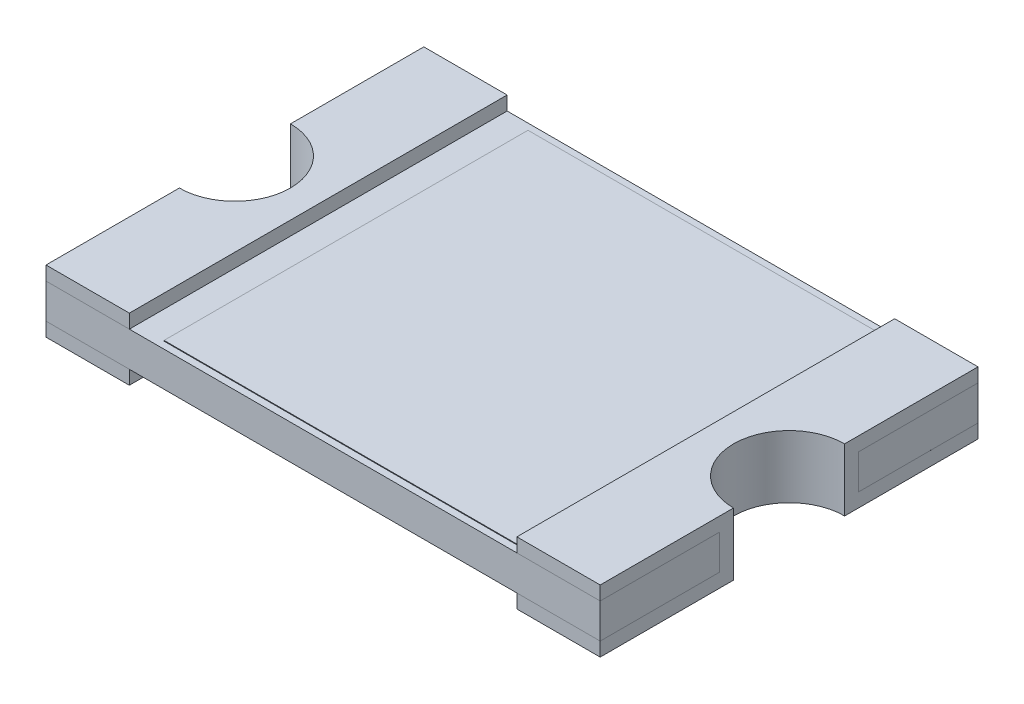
ISO-10303-21;
HEADER;
FILE_DESCRIPTION(('STEP AP214'),'2;1');
FILE_NAME('part.step','',(''),(''),'','','');
FILE_SCHEMA(('AUTOMOTIVE_DESIGN { 1 0 10303 214 1 1 1 1 }'));
ENDSEC;
DATA;
#1=APPLICATION_CONTEXT('core data for automotive mechanical design processes');
#2=APPLICATION_PROTOCOL_DEFINITION('international standard','automotive_design',2000,#1);
#3=PRODUCT_CONTEXT('',#1,'mechanical');
#4=PRODUCT('Part','Part','',(#3));
#5=PRODUCT_RELATED_PRODUCT_CATEGORY('part','',(#4));
#6=PRODUCT_DEFINITION_FORMATION('','',#4);
#7=PRODUCT_DEFINITION_CONTEXT('part definition',#1,'design');
#8=PRODUCT_DEFINITION('design','',#6,#7);
#9=PRODUCT_DEFINITION_SHAPE('','',#8);
#10=(LENGTH_UNIT() NAMED_UNIT(*) SI_UNIT(.MILLI.,.METRE.));
#11=(NAMED_UNIT(*) PLANE_ANGLE_UNIT() SI_UNIT($,.RADIAN.));
#12=(NAMED_UNIT(*) SI_UNIT($,.STERADIAN.) SOLID_ANGLE_UNIT());
#13=UNCERTAINTY_MEASURE_WITH_UNIT(LENGTH_MEASURE(1.E-05),#10,'distance_accuracy_value','');
#14=(GEOMETRIC_REPRESENTATION_CONTEXT(3) GLOBAL_UNCERTAINTY_ASSIGNED_CONTEXT((#13)) GLOBAL_UNIT_ASSIGNED_CONTEXT((#10,
#11,#12)) REPRESENTATION_CONTEXT('',''));
#15=CARTESIAN_POINT('',(0.,0.,0.));
#16=DIRECTION('',(0.,0.,1.));
#17=DIRECTION('',(1.,0.,0.));
#18=AXIS2_PLACEMENT_3D('',#15,#16,#17);
#19=CARTESIAN_POINT('',(-2.39,0.71,-2.62));
#20=DIRECTION('',(1.,0.,0.));
#21=DIRECTION('',(0.,0.,-1.));
#22=AXIS2_PLACEMENT_3D('',#19,#20,#21);
#23=PLANE('',#22);
#24=DIRECTION('',(0.,0.,1.));
#25=VECTOR('',#24,1.);
#26=CARTESIAN_POINT('',(-2.39,0.7,-2.62));
#27=LINE('',#26,#25);
#28=CARTESIAN_POINT('',(-2.39,0.7,-2.62));
#29=VERTEX_POINT('',#28);
#30=CARTESIAN_POINT('',(-2.39,0.7,2.62));
#31=VERTEX_POINT('',#30);
#32=EDGE_CURVE('E113',#29,#31,#27,.T.);
#33=ORIENTED_EDGE('',*,*,#32,.T.);
#34=DIRECTION('',(0.,-1.,0.));
#35=VECTOR('',#34,1.);
#36=CARTESIAN_POINT('',(-2.39,0.71,2.62));
#37=LINE('',#36,#35);
#38=CARTESIAN_POINT('',(-2.39,0.71,2.62));
#39=VERTEX_POINT('',#38);
#40=EDGE_CURVE('E12',#39,#31,#37,.T.);
#41=ORIENTED_EDGE('',*,*,#40,.F.);
#42=DIRECTION('',(0.,0.,1.));
#43=VECTOR('',#42,1.);
#44=CARTESIAN_POINT('',(-2.39,0.71,-2.62));
#45=LINE('',#44,#43);
#46=CARTESIAN_POINT('',(-2.39,0.71,-2.62));
#47=VERTEX_POINT('',#46);
#48=EDGE_CURVE('E101',#47,#39,#45,.T.);
#49=ORIENTED_EDGE('',*,*,#48,.F.);
#50=DIRECTION('',(0.,-1.,0.));
#51=VECTOR('',#50,1.);
#52=CARTESIAN_POINT('',(-2.39,0.71,-2.62));
#53=LINE('',#52,#51);
#54=EDGE_CURVE('E109',#47,#29,#53,.T.);
#55=ORIENTED_EDGE('',*,*,#54,.T.);
#56=EDGE_LOOP('',(#33,#41,#49,#55));
#57=FACE_BOUND('',#56,.T.);
#58=ADVANCED_FACE('F50',(#57),#23,.F.);
#59=CARTESIAN_POINT('',(-2.39,0.71,2.62));
#60=DIRECTION('',(0.,0.,-1.));
#61=DIRECTION('',(-1.,0.,0.));
#62=AXIS2_PLACEMENT_3D('',#59,#60,#61);
#63=PLANE('',#62);
#64=DIRECTION('',(1.,0.,0.));
#65=VECTOR('',#64,1.);
#66=CARTESIAN_POINT('',(-2.39,0.7,2.62));
#67=LINE('',#66,#65);
#68=CARTESIAN_POINT('',(2.79,0.7,2.62));
#69=VERTEX_POINT('',#68);
#70=EDGE_CURVE('E105',#31,#69,#67,.T.);
#71=ORIENTED_EDGE('',*,*,#70,.T.);
#72=DIRECTION('',(0.,-1.,0.));
#73=VECTOR('',#72,1.);
#74=CARTESIAN_POINT('',(2.79,0.71,2.62));
#75=LINE('',#74,#73);
#76=CARTESIAN_POINT('',(2.79,0.71,2.62));
#77=VERTEX_POINT('',#76);
#78=EDGE_CURVE('E58',#77,#69,#75,.T.);
#79=ORIENTED_EDGE('',*,*,#78,.F.);
#80=DIRECTION('',(1.,0.,0.));
#81=VECTOR('',#80,1.);
#82=CARTESIAN_POINT('',(-2.39,0.71,2.62));
#83=LINE('',#82,#81);
#84=EDGE_CURVE('E96',#39,#77,#83,.T.);
#85=ORIENTED_EDGE('',*,*,#84,.F.);
#86=ORIENTED_EDGE('',*,*,#40,.T.);
#87=EDGE_LOOP('',(#71,#79,#85,#86));
#88=FACE_BOUND('',#87,.T.);
#89=ADVANCED_FACE('F104',(#88),#63,.F.);
#90=CARTESIAN_POINT('',(2.79,0.71,-2.62));
#91=DIRECTION('',(-1.,0.,0.));
#92=DIRECTION('',(0.,0.,1.));
#93=AXIS2_PLACEMENT_3D('',#90,#91,#92);
#94=PLANE('',#93);
#95=DIRECTION('',(0.,0.,-1.));
#96=VECTOR('',#95,1.);
#97=CARTESIAN_POINT('',(2.79,0.7,-2.62));
#98=LINE('',#97,#96);
#99=CARTESIAN_POINT('',(2.79,0.7,-2.62));
#100=VERTEX_POINT('',#99);
#101=EDGE_CURVE('E83',#69,#100,#98,.T.);
#102=ORIENTED_EDGE('',*,*,#101,.T.);
#103=DIRECTION('',(0.,-1.,0.));
#104=VECTOR('',#103,1.);
#105=CARTESIAN_POINT('',(2.79,0.71,-2.62));
#106=LINE('',#105,#104);
#107=CARTESIAN_POINT('',(2.79,0.71,-2.62));
#108=VERTEX_POINT('',#107);
#109=EDGE_CURVE('E106',#108,#100,#106,.T.);
#110=ORIENTED_EDGE('',*,*,#109,.F.);
#111=DIRECTION('',(0.,0.,-1.));
#112=VECTOR('',#111,1.);
#113=CARTESIAN_POINT('',(2.79,0.71,-2.62));
#114=LINE('',#113,#112);
#115=EDGE_CURVE('E99',#77,#108,#114,.T.);
#116=ORIENTED_EDGE('',*,*,#115,.F.);
#117=ORIENTED_EDGE('',*,*,#78,.T.);
#118=EDGE_LOOP('',(#102,#110,#116,#117));
#119=FACE_BOUND('',#118,.T.);
#120=ADVANCED_FACE('F107',(#119),#94,.F.);
#121=CARTESIAN_POINT('',(-2.39,0.71,-2.62));
#122=DIRECTION('',(0.,0.,1.));
#123=DIRECTION('',(1.,0.,0.));
#124=AXIS2_PLACEMENT_3D('',#121,#122,#123);
#125=PLANE('',#124);
#126=DIRECTION('',(-1.,0.,0.));
#127=VECTOR('',#126,1.);
#128=CARTESIAN_POINT('',(-2.39,0.7,-2.62));
#129=LINE('',#128,#127);
#130=EDGE_CURVE('E89',#100,#29,#129,.T.);
#131=ORIENTED_EDGE('',*,*,#130,.T.);
#132=ORIENTED_EDGE('',*,*,#54,.F.);
#133=DIRECTION('',(-1.,0.,0.));
#134=VECTOR('',#133,1.);
#135=CARTESIAN_POINT('',(-2.39,0.71,-2.62));
#136=LINE('',#135,#134);
#137=EDGE_CURVE('E66',#108,#47,#136,.T.);
#138=ORIENTED_EDGE('',*,*,#137,.F.);
#139=ORIENTED_EDGE('',*,*,#109,.T.);
#140=EDGE_LOOP('',(#131,#132,#138,#139));
#141=FACE_BOUND('',#140,.T.);
#142=ADVANCED_FACE('F120',(#141),#125,.F.);
#143=CARTESIAN_POINT('',(0.,0.71,0.));
#144=DIRECTION('',(0.,1.,0.));
#145=DIRECTION('',(0.,0.,1.));
#146=AXIS2_PLACEMENT_3D('',#143,#144,#145);
#147=PLANE('',#146);
#148=ORIENTED_EDGE('',*,*,#48,.T.);
#149=ORIENTED_EDGE('',*,*,#84,.T.);
#150=ORIENTED_EDGE('',*,*,#115,.T.);
#151=ORIENTED_EDGE('',*,*,#137,.T.);
#152=EDGE_LOOP('',(#148,#149,#150,#151));
#153=FACE_BOUND('',#152,.T.);
#154=ADVANCED_FACE('F97',(#153),#147,.T.);
#155=CARTESIAN_POINT('',(0.,0.7,0.));
#156=DIRECTION('',(0.,1.,0.));
#157=DIRECTION('',(0.,0.,1.));
#158=AXIS2_PLACEMENT_3D('',#155,#156,#157);
#159=PLANE('',#158);
#160=ORIENTED_EDGE('',*,*,#32,.F.);
#161=ORIENTED_EDGE('',*,*,#130,.F.);
#162=ORIENTED_EDGE('',*,*,#101,.F.);
#163=ORIENTED_EDGE('',*,*,#70,.F.);
#164=EDGE_LOOP('',(#160,#161,#162,#163));
#165=FACE_BOUND('',#164,.T.);
#166=ADVANCED_FACE('F123',(#165),#159,.F.);
#167=CLOSED_SHELL('',(#58,#89,#120,#142,#154,#166));
#168=MANIFOLD_SOLID_BREP('B2',#167);
#169=CARTESIAN_POINT('',(3.99,0.7,-2.72));
#170=DIRECTION('',(1.,0.,0.));
#171=DIRECTION('',(0.,0.,-1.));
#172=AXIS2_PLACEMENT_3D('',#169,#170,#171);
#173=PLANE('',#172);
#174=DIRECTION('',(0.,0.,1.));
#175=VECTOR('',#174,1.);
#176=CARTESIAN_POINT('',(3.99,0.7,-2.72));
#177=LINE('',#176,#175);
#178=CARTESIAN_POINT('',(3.99,0.7,1.));
#179=VERTEX_POINT('',#178);
#180=CARTESIAN_POINT('',(3.99,0.7,2.72));
#181=VERTEX_POINT('',#180);
#182=EDGE_CURVE('E192',#179,#181,#177,.T.);
#183=ORIENTED_EDGE('',*,*,#182,.F.);
#184=DIRECTION('',(0.,-1.,0.));
#185=VECTOR('',#184,1.);
#186=CARTESIAN_POINT('',(3.99,0.9,1.));
#187=LINE('',#186,#185);
#188=CARTESIAN_POINT('',(3.99,0.2,1.));
#189=VERTEX_POINT('',#188);
#190=EDGE_CURVE('E332',#179,#189,#187,.T.);
#191=ORIENTED_EDGE('',*,*,#190,.T.);
#192=DIRECTION('',(0.,0.,1.));
#193=VECTOR('',#192,1.);
#194=CARTESIAN_POINT('',(3.99,0.2,-2.72));
#195=LINE('',#194,#193);
#196=CARTESIAN_POINT('',(3.99,0.2,2.72));
#197=VERTEX_POINT('',#196);
#198=EDGE_CURVE('E281',#189,#197,#195,.T.);
#199=ORIENTED_EDGE('',*,*,#198,.T.);
#200=DIRECTION('',(0.,1.,0.));
#201=VECTOR('',#200,1.);
#202=CARTESIAN_POINT('',(3.99,0.2,2.72));
#203=LINE('',#202,#201);
#204=CARTESIAN_POINT('',(3.99,0.,2.72));
#205=VERTEX_POINT('',#204);
#206=EDGE_CURVE('E306',#205,#197,#203,.T.);
#207=ORIENTED_EDGE('',*,*,#206,.F.);
#208=DIRECTION('',(0.,0.,-1.));
#209=VECTOR('',#208,1.);
#210=CARTESIAN_POINT('',(3.99,0.,0.8));
#211=LINE('',#210,#209);
#212=CARTESIAN_POINT('',(3.99,0.,0.8));
#213=VERTEX_POINT('',#212);
#214=EDGE_CURVE('E318',#205,#213,#211,.T.);
#215=ORIENTED_EDGE('',*,*,#214,.T.);
#216=DIRECTION('',(0.,-1.,0.));
#217=VECTOR('',#216,1.);
#218=CARTESIAN_POINT('',(3.99,0.9,0.8));
#219=LINE('',#218,#217);
#220=CARTESIAN_POINT('',(3.99,0.9,0.8));
#221=VERTEX_POINT('',#220);
#222=EDGE_CURVE('E329',#221,#213,#219,.T.);
#223=ORIENTED_EDGE('',*,*,#222,.F.);
#224=DIRECTION('',(0.,0.,1.));
#225=VECTOR('',#224,1.);
#226=CARTESIAN_POINT('',(3.99,0.9,-2.72));
#227=LINE('',#226,#225);
#228=CARTESIAN_POINT('',(3.99,0.9,2.72));
#229=VERTEX_POINT('',#228);
#230=EDGE_CURVE('E350',#221,#229,#227,.T.);
#231=ORIENTED_EDGE('',*,*,#230,.T.);
#232=DIRECTION('',(0.,1.,0.));
#233=VECTOR('',#232,1.);
#234=CARTESIAN_POINT('',(3.99,0.7,2.72));
#235=LINE('',#234,#233);
#236=EDGE_CURVE('E336',#181,#229,#235,.T.);
#237=ORIENTED_EDGE('',*,*,#236,.F.);
#238=EDGE_LOOP('',(#183,#191,#199,#207,#215,#223,#231,#237));
#239=FACE_BOUND('',#238,.T.);
#240=ADVANCED_FACE('F184',(#239),#173,.T.);
#241=CARTESIAN_POINT('',(3.99,0.9,-2.72));
#242=VERTEX_POINT('',#241);
#243=CARTESIAN_POINT('',(3.99,0.9,-0.8));
#244=VERTEX_POINT('',#243);
#245=EDGE_CURVE('E187',#242,#244,#227,.T.);
#246=ORIENTED_EDGE('',*,*,#245,.T.);
#247=DIRECTION('',(0.,-1.,0.));
#248=VECTOR('',#247,1.);
#249=CARTESIAN_POINT('',(3.99,0.9,-0.8));
#250=LINE('',#249,#248);
#251=CARTESIAN_POINT('',(3.99,0.,-0.8));
#252=VERTEX_POINT('',#251);
#253=EDGE_CURVE('E327',#244,#252,#250,.T.);
#254=ORIENTED_EDGE('',*,*,#253,.T.);
#255=DIRECTION('',(0.,0.,-1.));
#256=VECTOR('',#255,1.);
#257=CARTESIAN_POINT('',(3.99,0.,-1.));
#258=LINE('',#257,#256);
#259=CARTESIAN_POINT('',(3.99,0.,-2.72));
#260=VERTEX_POINT('',#259);
#261=EDGE_CURVE('E296',#252,#260,#258,.T.);
#262=ORIENTED_EDGE('',*,*,#261,.T.);
#263=DIRECTION('',(0.,1.,0.));
#264=VECTOR('',#263,1.);
#265=CARTESIAN_POINT('',(3.99,0.2,-2.72));
#266=LINE('',#265,#264);
#267=CARTESIAN_POINT('',(3.99,0.2,-2.72));
#268=VERTEX_POINT('',#267);
#269=EDGE_CURVE('E288',#260,#268,#266,.T.);
#270=ORIENTED_EDGE('',*,*,#269,.T.);
#271=CARTESIAN_POINT('',(3.99,0.2,-1.));
#272=VERTEX_POINT('',#271);
#273=EDGE_CURVE('E273',#268,#272,#195,.T.);
#274=ORIENTED_EDGE('',*,*,#273,.T.);
#275=DIRECTION('',(0.,-1.,0.));
#276=VECTOR('',#275,1.);
#277=CARTESIAN_POINT('',(3.99,0.9,-1.));
#278=LINE('',#277,#276);
#279=CARTESIAN_POINT('',(3.99,0.7,-1.));
#280=VERTEX_POINT('',#279);
#281=EDGE_CURVE('E205',#280,#272,#278,.T.);
#282=ORIENTED_EDGE('',*,*,#281,.F.);
#283=CARTESIAN_POINT('',(3.99,0.7,-2.72));
#284=VERTEX_POINT('',#283);
#285=EDGE_CURVE('E48',#284,#280,#177,.T.);
#286=ORIENTED_EDGE('',*,*,#285,.F.);
#287=DIRECTION('',(0.,1.,0.));
#288=VECTOR('',#287,1.);
#289=CARTESIAN_POINT('',(3.99,0.7,-2.72));
#290=LINE('',#289,#288);
#291=EDGE_CURVE('E337',#284,#242,#290,.T.);
#292=ORIENTED_EDGE('',*,*,#291,.T.);
#293=EDGE_LOOP('',(#246,#254,#262,#270,#274,#282,#286,#292));
#294=FACE_BOUND('',#293,.T.);
#295=ADVANCED_FACE('F293',(#294),#173,.T.);
#296=CARTESIAN_POINT('',(3.99,0.7,-2.72));
#297=DIRECTION('',(0.,-1.,0.));
#298=DIRECTION('',(0.,0.,-1.));
#299=AXIS2_PLACEMENT_3D('',#296,#297,#298);
#300=PLANE('',#299);
#301=ORIENTED_EDGE('',*,*,#285,.T.);
#302=CARTESIAN_POINT('',(3.99,0.7,0.));
#303=DIRECTION('',(0.,-1.,0.));
#304=DIRECTION('',(0.,0.,-1.));
#305=AXIS2_PLACEMENT_3D('',#302,#303,#304);
#306=CIRCLE('',#305,1.);
#307=EDGE_CURVE('E334',#280,#179,#306,.F.);
#308=ORIENTED_EDGE('',*,*,#307,.T.);
#309=ORIENTED_EDGE('',*,*,#182,.T.);
#310=DIRECTION('',(1.,0.,0.));
#311=VECTOR('',#310,1.);
#312=CARTESIAN_POINT('',(3.99,0.7,2.72));
#313=LINE('',#312,#311);
#314=CARTESIAN_POINT('',(2.79,0.7,2.72));
#315=VERTEX_POINT('',#314);
#316=EDGE_CURVE('E341',#315,#181,#313,.T.);
#317=ORIENTED_EDGE('',*,*,#316,.F.);
#318=DIRECTION('',(0.,0.,1.));
#319=VECTOR('',#318,1.);
#320=CARTESIAN_POINT('',(2.79,0.7,-2.72));
#321=LINE('',#320,#319);
#322=CARTESIAN_POINT('',(2.79,0.7,-2.72));
#323=VERTEX_POINT('',#322);
#324=EDGE_CURVE('E361',#323,#315,#321,.T.);
#325=ORIENTED_EDGE('',*,*,#324,.F.);
#326=DIRECTION('',(1.,0.,0.));
#327=VECTOR('',#326,1.);
#328=CARTESIAN_POINT('',(3.99,0.7,-2.72));
#329=LINE('',#328,#327);
#330=EDGE_CURVE('E347',#323,#284,#329,.T.);
#331=ORIENTED_EDGE('',*,*,#330,.T.);
#332=EDGE_LOOP('',(#301,#308,#309,#317,#325,#331));
#333=FACE_BOUND('',#332,.T.);
#334=ADVANCED_FACE('F376',(#333),#300,.T.);
#335=CARTESIAN_POINT('',(3.99,0.9,-2.72));
#336=DIRECTION('',(0.,1.,0.));
#337=DIRECTION('',(0.,0.,1.));
#338=AXIS2_PLACEMENT_3D('',#335,#336,#337);
#339=PLANE('',#338);
#340=ORIENTED_EDGE('',*,*,#230,.F.);
#341=CARTESIAN_POINT('',(3.99,0.9,0.));
#342=DIRECTION('',(0.,-1.,0.));
#343=DIRECTION('',(0.,0.,1.));
#344=AXIS2_PLACEMENT_3D('',#341,#342,#343);
#345=CIRCLE('',#344,0.8);
#346=EDGE_CURVE('E319',#221,#244,#345,.T.);
#347=ORIENTED_EDGE('',*,*,#346,.T.);
#348=ORIENTED_EDGE('',*,*,#245,.F.);
#349=DIRECTION('',(-1.,0.,0.));
#350=VECTOR('',#349,1.);
#351=CARTESIAN_POINT('',(3.99,0.9,-2.72));
#352=LINE('',#351,#350);
#353=CARTESIAN_POINT('',(2.79,0.9,-2.72));
#354=VERTEX_POINT('',#353);
#355=EDGE_CURVE('E340',#242,#354,#352,.T.);
#356=ORIENTED_EDGE('',*,*,#355,.T.);
#357=DIRECTION('',(0.,0.,1.));
#358=VECTOR('',#357,1.);
#359=CARTESIAN_POINT('',(2.79,0.9,-2.72));
#360=LINE('',#359,#358);
#361=CARTESIAN_POINT('',(2.79,0.9,2.72));
#362=VERTEX_POINT('',#361);
#363=EDGE_CURVE('E362',#354,#362,#360,.T.);
#364=ORIENTED_EDGE('',*,*,#363,.T.);
#365=DIRECTION('',(-1.,0.,0.));
#366=VECTOR('',#365,1.);
#367=CARTESIAN_POINT('',(3.99,0.9,2.72));
#368=LINE('',#367,#366);
#369=EDGE_CURVE('E353',#229,#362,#368,.T.);
#370=ORIENTED_EDGE('',*,*,#369,.F.);
#371=EDGE_LOOP('',(#340,#347,#348,#356,#364,#370));
#372=FACE_BOUND('',#371,.T.);
#373=ADVANCED_FACE('F371',(#372),#339,.T.);
#374=CARTESIAN_POINT('',(2.79,0.7,-2.72));
#375=DIRECTION('',(-1.,0.,0.));
#376=DIRECTION('',(0.,0.,1.));
#377=AXIS2_PLACEMENT_3D('',#374,#375,#376);
#378=PLANE('',#377);
#379=DIRECTION('',(0.,-1.,0.));
#380=VECTOR('',#379,1.);
#381=CARTESIAN_POINT('',(2.79,0.7,2.72));
#382=LINE('',#381,#380);
#383=EDGE_CURVE('E356',#362,#315,#382,.T.);
#384=ORIENTED_EDGE('',*,*,#383,.F.);
#385=ORIENTED_EDGE('',*,*,#363,.F.);
#386=DIRECTION('',(0.,-1.,0.));
#387=VECTOR('',#386,1.);
#388=CARTESIAN_POINT('',(2.79,0.7,-2.72));
#389=LINE('',#388,#387);
#390=EDGE_CURVE('E344',#354,#323,#389,.T.);
#391=ORIENTED_EDGE('',*,*,#390,.T.);
#392=ORIENTED_EDGE('',*,*,#324,.T.);
#393=EDGE_LOOP('',(#384,#385,#391,#392));
#394=FACE_BOUND('',#393,.T.);
#395=ADVANCED_FACE('F416',(#394),#378,.T.);
#396=CARTESIAN_POINT('',(0.,0.,-2.72));
#397=DIRECTION('',(0.,0.,1.));
#398=DIRECTION('',(1.,0.,0.));
#399=AXIS2_PLACEMENT_3D('',#396,#397,#398);
#400=PLANE('',#399);
#401=ORIENTED_EDGE('',*,*,#291,.F.);
#402=ORIENTED_EDGE('',*,*,#330,.F.);
#403=ORIENTED_EDGE('',*,*,#390,.F.);
#404=ORIENTED_EDGE('',*,*,#355,.F.);
#405=EDGE_LOOP('',(#401,#402,#403,#404));
#406=FACE_BOUND('',#405,.T.);
#407=ADVANCED_FACE('F382',(#406),#400,.F.);
#408=CARTESIAN_POINT('',(0.,0.,2.72));
#409=DIRECTION('',(0.,0.,1.));
#410=DIRECTION('',(1.,0.,0.));
#411=AXIS2_PLACEMENT_3D('',#408,#409,#410);
#412=PLANE('',#411);
#413=ORIENTED_EDGE('',*,*,#236,.T.);
#414=ORIENTED_EDGE('',*,*,#369,.T.);
#415=ORIENTED_EDGE('',*,*,#383,.T.);
#416=ORIENTED_EDGE('',*,*,#316,.T.);
#417=EDGE_LOOP('',(#413,#414,#415,#416));
#418=FACE_BOUND('',#417,.T.);
#419=ADVANCED_FACE('F373',(#418),#412,.T.);
#420=CARTESIAN_POINT('',(3.99,0.9,0.));
#421=DIRECTION('',(0.,-1.,0.));
#422=DIRECTION('',(0.,0.,-1.));
#423=AXIS2_PLACEMENT_3D('',#420,#421,#422);
#424=CYLINDRICAL_SURFACE('',#423,1.);
#425=ORIENTED_EDGE('',*,*,#281,.T.);
#426=CARTESIAN_POINT('',(3.99,0.2,0.));
#427=DIRECTION('',(0.,1.,0.));
#428=DIRECTION('',(0.,0.,1.));
#429=AXIS2_PLACEMENT_3D('',#426,#427,#428);
#430=CIRCLE('',#429,1.);
#431=EDGE_CURVE('E200',#189,#272,#430,.F.);
#432=ORIENTED_EDGE('',*,*,#431,.F.);
#433=ORIENTED_EDGE('',*,*,#190,.F.);
#434=ORIENTED_EDGE('',*,*,#307,.F.);
#435=EDGE_LOOP('',(#425,#432,#433,#434));
#436=FACE_BOUND('',#435,.T.);
#437=ADVANCED_FACE('F377',(#436),#424,.T.);
#438=CARTESIAN_POINT('',(3.99,0.9,0.));
#439=DIRECTION('',(0.,-1.,0.));
#440=DIRECTION('',(0.,0.,-1.));
#441=AXIS2_PLACEMENT_3D('',#438,#439,#440);
#442=CYLINDRICAL_SURFACE('',#441,0.8);
#443=CARTESIAN_POINT('',(3.99,0.,0.));
#444=DIRECTION('',(0.,-1.,0.));
#445=DIRECTION('',(0.,0.,1.));
#446=AXIS2_PLACEMENT_3D('',#443,#444,#445);
#447=CIRCLE('',#446,0.8);
#448=EDGE_CURVE('E323',#213,#252,#447,.T.);
#449=ORIENTED_EDGE('',*,*,#448,.T.);
#450=ORIENTED_EDGE('',*,*,#253,.F.);
#451=ORIENTED_EDGE('',*,*,#346,.F.);
#452=ORIENTED_EDGE('',*,*,#222,.T.);
#453=EDGE_LOOP('',(#449,#450,#451,#452));
#454=FACE_BOUND('',#453,.T.);
#455=ADVANCED_FACE('F386',(#454),#442,.F.);
#456=CARTESIAN_POINT('',(3.99,0.,0.));
#457=DIRECTION('',(0.,1.,0.));
#458=DIRECTION('',(0.,0.,1.));
#459=AXIS2_PLACEMENT_3D('',#456,#457,#458);
#460=PLANE('',#459);
#461=ORIENTED_EDGE('',*,*,#214,.F.);
#462=DIRECTION('',(1.,0.,0.));
#463=VECTOR('',#462,1.);
#464=CARTESIAN_POINT('',(3.99,0.,2.72));
#465=LINE('',#464,#463);
#466=CARTESIAN_POINT('',(2.79,0.,2.72));
#467=VERTEX_POINT('',#466);
#468=EDGE_CURVE('E297',#467,#205,#465,.T.);
#469=ORIENTED_EDGE('',*,*,#468,.F.);
#470=DIRECTION('',(0.,0.,1.));
#471=VECTOR('',#470,1.);
#472=CARTESIAN_POINT('',(2.79,0.,-2.72));
#473=LINE('',#472,#471);
#474=CARTESIAN_POINT('',(2.79,0.,-2.72));
#475=VERTEX_POINT('',#474);
#476=EDGE_CURVE('E314',#475,#467,#473,.T.);
#477=ORIENTED_EDGE('',*,*,#476,.F.);
#478=DIRECTION('',(1.,0.,0.));
#479=VECTOR('',#478,1.);
#480=CARTESIAN_POINT('',(3.99,0.,-2.72));
#481=LINE('',#480,#479);
#482=EDGE_CURVE('E304',#475,#260,#481,.T.);
#483=ORIENTED_EDGE('',*,*,#482,.T.);
#484=ORIENTED_EDGE('',*,*,#261,.F.);
#485=ORIENTED_EDGE('',*,*,#448,.F.);
#486=EDGE_LOOP('',(#461,#469,#477,#483,#484,#485));
#487=FACE_BOUND('',#486,.T.);
#488=ADVANCED_FACE('F389',(#487),#460,.F.);
#489=CARTESIAN_POINT('',(3.99,0.2,-2.72));
#490=DIRECTION('',(0.,1.,0.));
#491=DIRECTION('',(0.,0.,1.));
#492=AXIS2_PLACEMENT_3D('',#489,#490,#491);
#493=PLANE('',#492);
#494=ORIENTED_EDGE('',*,*,#198,.F.);
#495=ORIENTED_EDGE('',*,*,#431,.T.);
#496=ORIENTED_EDGE('',*,*,#273,.F.);
#497=DIRECTION('',(-1.,0.,0.));
#498=VECTOR('',#497,1.);
#499=CARTESIAN_POINT('',(3.99,0.2,-2.72));
#500=LINE('',#499,#498);
#501=CARTESIAN_POINT('',(2.79,0.2,-2.72));
#502=VERTEX_POINT('',#501);
#503=EDGE_CURVE('E277',#268,#502,#500,.T.);
#504=ORIENTED_EDGE('',*,*,#503,.T.);
#505=DIRECTION('',(0.,0.,1.));
#506=VECTOR('',#505,1.);
#507=CARTESIAN_POINT('',(2.79,0.2,-2.72));
#508=LINE('',#507,#506);
#509=CARTESIAN_POINT('',(2.79,0.2,2.72));
#510=VERTEX_POINT('',#509);
#511=EDGE_CURVE('E280',#502,#510,#508,.T.);
#512=ORIENTED_EDGE('',*,*,#511,.T.);
#513=DIRECTION('',(-1.,0.,0.));
#514=VECTOR('',#513,1.);
#515=CARTESIAN_POINT('',(3.99,0.2,2.72));
#516=LINE('',#515,#514);
#517=EDGE_CURVE('E309',#197,#510,#516,.T.);
#518=ORIENTED_EDGE('',*,*,#517,.F.);
#519=EDGE_LOOP('',(#494,#495,#496,#504,#512,#518));
#520=FACE_BOUND('',#519,.T.);
#521=ADVANCED_FACE('F276',(#520),#493,.T.);
#522=CARTESIAN_POINT('',(2.79,0.2,-2.72));
#523=DIRECTION('',(-1.,0.,0.));
#524=DIRECTION('',(0.,0.,1.));
#525=AXIS2_PLACEMENT_3D('',#522,#523,#524);
#526=PLANE('',#525);
#527=DIRECTION('',(0.,-1.,0.));
#528=VECTOR('',#527,1.);
#529=CARTESIAN_POINT('',(2.79,0.2,2.72));
#530=LINE('',#529,#528);
#531=EDGE_CURVE('E300',#510,#467,#530,.T.);
#532=ORIENTED_EDGE('',*,*,#531,.F.);
#533=ORIENTED_EDGE('',*,*,#511,.F.);
#534=DIRECTION('',(0.,-1.,0.));
#535=VECTOR('',#534,1.);
#536=CARTESIAN_POINT('',(2.79,0.2,-2.72));
#537=LINE('',#536,#535);
#538=EDGE_CURVE('E291',#502,#475,#537,.T.);
#539=ORIENTED_EDGE('',*,*,#538,.T.);
#540=ORIENTED_EDGE('',*,*,#476,.T.);
#541=EDGE_LOOP('',(#532,#533,#539,#540));
#542=FACE_BOUND('',#541,.T.);
#543=ADVANCED_FACE('F393',(#542),#526,.T.);
#544=CARTESIAN_POINT('',(0.,0.,-2.72));
#545=DIRECTION('',(0.,0.,-1.));
#546=DIRECTION('',(-1.,0.,0.));
#547=AXIS2_PLACEMENT_3D('',#544,#545,#546);
#548=PLANE('',#547);
#549=ORIENTED_EDGE('',*,*,#269,.F.);
#550=ORIENTED_EDGE('',*,*,#482,.F.);
#551=ORIENTED_EDGE('',*,*,#538,.F.);
#552=ORIENTED_EDGE('',*,*,#503,.F.);
#553=EDGE_LOOP('',(#549,#550,#551,#552));
#554=FACE_BOUND('',#553,.T.);
#555=ADVANCED_FACE('F286',(#554),#548,.T.);
#556=CARTESIAN_POINT('',(0.,0.,2.72));
#557=DIRECTION('',(0.,0.,-1.));
#558=DIRECTION('',(-1.,0.,0.));
#559=AXIS2_PLACEMENT_3D('',#556,#557,#558);
#560=PLANE('',#559);
#561=ORIENTED_EDGE('',*,*,#206,.T.);
#562=ORIENTED_EDGE('',*,*,#517,.T.);
#563=ORIENTED_EDGE('',*,*,#531,.T.);
#564=ORIENTED_EDGE('',*,*,#468,.T.);
#565=EDGE_LOOP('',(#561,#562,#563,#564));
#566=FACE_BOUND('',#565,.T.);
#567=ADVANCED_FACE('F397',(#566),#560,.F.);
#568=CLOSED_SHELL('',(#240,#295,#334,#373,#395,#407,#419,#437,#455,#488,#521,#543,#555,#567));
#569=MANIFOLD_SOLID_BREP('B6',#568);
#570=CARTESIAN_POINT('',(-3.99,0.7,-2.72));
#571=DIRECTION('',(-1.,0.,0.));
#572=DIRECTION('',(0.,0.,1.));
#573=AXIS2_PLACEMENT_3D('',#570,#571,#572);
#574=PLANE('',#573);
#575=DIRECTION('',(0.,0.,1.));
#576=VECTOR('',#575,1.);
#577=CARTESIAN_POINT('',(-3.99,0.7,-2.72));
#578=LINE('',#577,#576);
#579=CARTESIAN_POINT('',(-3.99,0.7,-2.72));
#580=VERTEX_POINT('',#579);
#581=CARTESIAN_POINT('',(-3.99,0.7,-1.));
#582=VERTEX_POINT('',#581);
#583=EDGE_CURVE('E718',#580,#582,#578,.T.);
#584=ORIENTED_EDGE('',*,*,#583,.T.);
#585=DIRECTION('',(0.,-1.,0.));
#586=VECTOR('',#585,1.);
#587=CARTESIAN_POINT('',(-3.99,0.9,-1.));
#588=LINE('',#587,#586);
#589=CARTESIAN_POINT('',(-3.99,0.2,-1.));
#590=VERTEX_POINT('',#589);
#591=EDGE_CURVE('E686',#582,#590,#588,.T.);
#592=ORIENTED_EDGE('',*,*,#591,.T.);
#593=DIRECTION('',(0.,0.,1.));
#594=VECTOR('',#593,1.);
#595=CARTESIAN_POINT('',(-3.99,0.2,-2.72));
#596=LINE('',#595,#594);
#597=CARTESIAN_POINT('',(-3.99,0.2,-2.72));
#598=VERTEX_POINT('',#597);
#599=EDGE_CURVE('E636',#598,#590,#596,.T.);
#600=ORIENTED_EDGE('',*,*,#599,.F.);
#601=DIRECTION('',(0.,-1.,0.));
#602=VECTOR('',#601,1.);
#603=CARTESIAN_POINT('',(-3.99,0.2,-2.72));
#604=LINE('',#603,#602);
#605=CARTESIAN_POINT('',(-3.99,0.,-2.72));
#606=VERTEX_POINT('',#605);
#607=EDGE_CURVE('E643',#598,#606,#604,.T.);
#608=ORIENTED_EDGE('',*,*,#607,.T.);
#609=DIRECTION('',(0.,0.,1.));
#610=VECTOR('',#609,1.);
#611=CARTESIAN_POINT('',(-3.99,0.,-1.));
#612=LINE('',#611,#610);
#613=CARTESIAN_POINT('',(-3.99,0.,-0.8));
#614=VERTEX_POINT('',#613);
#615=EDGE_CURVE('E626',#606,#614,#612,.T.);
#616=ORIENTED_EDGE('',*,*,#615,.T.);
#617=DIRECTION('',(0.,-1.,0.));
#618=VECTOR('',#617,1.);
#619=CARTESIAN_POINT('',(-3.99,0.9,-0.8));
#620=LINE('',#619,#618);
#621=CARTESIAN_POINT('',(-3.99,0.9,-0.8));
#622=VERTEX_POINT('',#621);
#623=EDGE_CURVE('E684',#622,#614,#620,.T.);
#624=ORIENTED_EDGE('',*,*,#623,.F.);
#625=DIRECTION('',(0.,0.,1.));
#626=VECTOR('',#625,1.);
#627=CARTESIAN_POINT('',(-3.99,0.9,-2.72));
#628=LINE('',#627,#626);
#629=CARTESIAN_POINT('',(-3.99,0.9,-2.72));
#630=VERTEX_POINT('',#629);
#631=EDGE_CURVE('E546',#630,#622,#628,.T.);
#632=ORIENTED_EDGE('',*,*,#631,.F.);
#633=DIRECTION('',(0.,-1.,0.));
#634=VECTOR('',#633,1.);
#635=CARTESIAN_POINT('',(-3.99,0.7,-2.72));
#636=LINE('',#635,#634);
#637=EDGE_CURVE('E689',#630,#580,#636,.T.);
#638=ORIENTED_EDGE('',*,*,#637,.T.);
#639=EDGE_LOOP('',(#584,#592,#600,#608,#616,#624,#632,#638));
#640=FACE_BOUND('',#639,.T.);
#641=ADVANCED_FACE('F539',(#640),#574,.T.);
#642=CARTESIAN_POINT('',(-3.99,0.9,0.8));
#643=VERTEX_POINT('',#642);
#644=CARTESIAN_POINT('',(-3.99,0.9,2.72));
#645=VERTEX_POINT('',#644);
#646=EDGE_CURVE('E714',#643,#645,#628,.T.);
#647=ORIENTED_EDGE('',*,*,#646,.F.);
#648=DIRECTION('',(0.,-1.,0.));
#649=VECTOR('',#648,1.);
#650=CARTESIAN_POINT('',(-3.99,0.9,0.8));
#651=LINE('',#650,#649);
#652=CARTESIAN_POINT('',(-3.99,0.,0.8));
#653=VERTEX_POINT('',#652);
#654=EDGE_CURVE('E681',#643,#653,#651,.T.);
#655=ORIENTED_EDGE('',*,*,#654,.T.);
#656=DIRECTION('',(0.,0.,1.));
#657=VECTOR('',#656,1.);
#658=CARTESIAN_POINT('',(-3.99,0.,0.8));
#659=LINE('',#658,#657);
#660=CARTESIAN_POINT('',(-3.99,0.,2.72));
#661=VERTEX_POINT('',#660);
#662=EDGE_CURVE('E676',#653,#661,#659,.T.);
#663=ORIENTED_EDGE('',*,*,#662,.T.);
#664=DIRECTION('',(0.,-1.,0.));
#665=VECTOR('',#664,1.);
#666=CARTESIAN_POINT('',(-3.99,0.2,2.72));
#667=LINE('',#666,#665);
#668=CARTESIAN_POINT('',(-3.99,0.2,2.72));
#669=VERTEX_POINT('',#668);
#670=EDGE_CURVE('E661',#669,#661,#667,.T.);
#671=ORIENTED_EDGE('',*,*,#670,.F.);
#672=CARTESIAN_POINT('',(-3.99,0.2,1.));
#673=VERTEX_POINT('',#672);
#674=EDGE_CURVE('E670',#673,#669,#596,.T.);
#675=ORIENTED_EDGE('',*,*,#674,.F.);
#676=DIRECTION('',(0.,-1.,0.));
#677=VECTOR('',#676,1.);
#678=CARTESIAN_POINT('',(-3.99,0.9,1.));
#679=LINE('',#678,#677);
#680=CARTESIAN_POINT('',(-3.99,0.7,1.));
#681=VERTEX_POINT('',#680);
#682=EDGE_CURVE('E558',#681,#673,#679,.T.);
#683=ORIENTED_EDGE('',*,*,#682,.F.);
#684=CARTESIAN_POINT('',(-3.99,0.7,2.72));
#685=VERTEX_POINT('',#684);
#686=EDGE_CURVE('E702',#681,#685,#578,.T.);
#687=ORIENTED_EDGE('',*,*,#686,.T.);
#688=DIRECTION('',(0.,-1.,0.));
#689=VECTOR('',#688,1.);
#690=CARTESIAN_POINT('',(-3.99,0.7,2.72));
#691=LINE('',#690,#689);
#692=EDGE_CURVE('E688',#645,#685,#691,.T.);
#693=ORIENTED_EDGE('',*,*,#692,.F.);
#694=EDGE_LOOP('',(#647,#655,#663,#671,#675,#683,#687,#693));
#695=FACE_BOUND('',#694,.T.);
#696=ADVANCED_FACE('F722',(#695),#574,.T.);
#697=CARTESIAN_POINT('',(-3.99,0.9,-2.72));
#698=DIRECTION('',(0.,1.,0.));
#699=DIRECTION('',(0.,0.,1.));
#700=AXIS2_PLACEMENT_3D('',#697,#698,#699);
#701=PLANE('',#700);
#702=ORIENTED_EDGE('',*,*,#631,.T.);
#703=CARTESIAN_POINT('',(-3.99,0.9,0.));
#704=DIRECTION('',(0.,-1.,0.));
#705=DIRECTION('',(0.,0.,1.));
#706=AXIS2_PLACEMENT_3D('',#703,#704,#705);
#707=CIRCLE('',#706,0.8);
#708=EDGE_CURVE('E674',#622,#643,#707,.T.);
#709=ORIENTED_EDGE('',*,*,#708,.T.);
#710=ORIENTED_EDGE('',*,*,#646,.T.);
#711=DIRECTION('',(-1.,0.,0.));
#712=VECTOR('',#711,1.);
#713=CARTESIAN_POINT('',(-3.99,0.9,2.72));
#714=LINE('',#713,#712);
#715=CARTESIAN_POINT('',(-2.79,0.9,2.72));
#716=VERTEX_POINT('',#715);
#717=EDGE_CURVE('E693',#716,#645,#714,.T.);
#718=ORIENTED_EDGE('',*,*,#717,.F.);
#719=DIRECTION('',(0.,0.,1.));
#720=VECTOR('',#719,1.);
#721=CARTESIAN_POINT('',(-2.79,0.9,-2.72));
#722=LINE('',#721,#720);
#723=CARTESIAN_POINT('',(-2.79,0.9,-2.72));
#724=VERTEX_POINT('',#723);
#725=EDGE_CURVE('E715',#724,#716,#722,.T.);
#726=ORIENTED_EDGE('',*,*,#725,.F.);
#727=DIRECTION('',(-1.,0.,0.));
#728=VECTOR('',#727,1.);
#729=CARTESIAN_POINT('',(-3.99,0.9,-2.72));
#730=LINE('',#729,#728);
#731=EDGE_CURVE('E699',#724,#630,#730,.T.);
#732=ORIENTED_EDGE('',*,*,#731,.T.);
#733=EDGE_LOOP('',(#702,#709,#710,#718,#726,#732));
#734=FACE_BOUND('',#733,.T.);
#735=ADVANCED_FACE('F731',(#734),#701,.T.);
#736=CARTESIAN_POINT('',(-3.99,0.7,-2.72));
#737=DIRECTION('',(0.,-1.,0.));
#738=DIRECTION('',(0.,0.,-1.));
#739=AXIS2_PLACEMENT_3D('',#736,#737,#738);
#740=PLANE('',#739);
#741=ORIENTED_EDGE('',*,*,#686,.F.);
#742=CARTESIAN_POINT('',(-3.99,0.7,0.));
#743=DIRECTION('',(0.,-1.,0.));
#744=DIRECTION('',(0.,0.,-1.));
#745=AXIS2_PLACEMENT_3D('',#742,#743,#744);
#746=CIRCLE('',#745,1.);
#747=EDGE_CURVE('E182',#681,#582,#746,.F.);
#748=ORIENTED_EDGE('',*,*,#747,.T.);
#749=ORIENTED_EDGE('',*,*,#583,.F.);
#750=DIRECTION('',(1.,0.,0.));
#751=VECTOR('',#750,1.);
#752=CARTESIAN_POINT('',(-3.99,0.7,-2.72));
#753=LINE('',#752,#751);
#754=CARTESIAN_POINT('',(-2.79,0.7,-2.72));
#755=VERTEX_POINT('',#754);
#756=EDGE_CURVE('E692',#580,#755,#753,.T.);
#757=ORIENTED_EDGE('',*,*,#756,.T.);
#758=DIRECTION('',(0.,0.,1.));
#759=VECTOR('',#758,1.);
#760=CARTESIAN_POINT('',(-2.79,0.7,-2.72));
#761=LINE('',#760,#759);
#762=CARTESIAN_POINT('',(-2.79,0.7,2.72));
#763=VERTEX_POINT('',#762);
#764=EDGE_CURVE('E717',#755,#763,#761,.T.);
#765=ORIENTED_EDGE('',*,*,#764,.T.);
#766=DIRECTION('',(1.,0.,0.));
#767=VECTOR('',#766,1.);
#768=CARTESIAN_POINT('',(-3.99,0.7,2.72));
#769=LINE('',#768,#767);
#770=EDGE_CURVE('E705',#685,#763,#769,.T.);
#771=ORIENTED_EDGE('',*,*,#770,.F.);
#772=EDGE_LOOP('',(#741,#748,#749,#757,#765,#771));
#773=FACE_BOUND('',#772,.T.);
#774=ADVANCED_FACE('F725',(#773),#740,.T.);
#775=CARTESIAN_POINT('',(-2.79,0.7,-2.72));
#776=DIRECTION('',(1.,0.,0.));
#777=DIRECTION('',(0.,0.,-1.));
#778=AXIS2_PLACEMENT_3D('',#775,#776,#777);
#779=PLANE('',#778);
#780=DIRECTION('',(0.,1.,0.));
#781=VECTOR('',#780,1.);
#782=CARTESIAN_POINT('',(-2.79,0.7,2.72));
#783=LINE('',#782,#781);
#784=EDGE_CURVE('E708',#763,#716,#783,.T.);
#785=ORIENTED_EDGE('',*,*,#784,.F.);
#786=ORIENTED_EDGE('',*,*,#764,.F.);
#787=DIRECTION('',(0.,1.,0.));
#788=VECTOR('',#787,1.);
#789=CARTESIAN_POINT('',(-2.79,0.7,-2.72));
#790=LINE('',#789,#788);
#791=EDGE_CURVE('E696',#755,#724,#790,.T.);
#792=ORIENTED_EDGE('',*,*,#791,.T.);
#793=ORIENTED_EDGE('',*,*,#725,.T.);
#794=EDGE_LOOP('',(#785,#786,#792,#793));
#795=FACE_BOUND('',#794,.T.);
#796=ADVANCED_FACE('F765',(#795),#779,.T.);
#797=CARTESIAN_POINT('',(0.,0.,-2.72));
#798=DIRECTION('',(0.,0.,-1.));
#799=DIRECTION('',(-1.,0.,0.));
#800=AXIS2_PLACEMENT_3D('',#797,#798,#799);
#801=PLANE('',#800);
#802=ORIENTED_EDGE('',*,*,#637,.F.);
#803=ORIENTED_EDGE('',*,*,#731,.F.);
#804=ORIENTED_EDGE('',*,*,#791,.F.);
#805=ORIENTED_EDGE('',*,*,#756,.F.);
#806=EDGE_LOOP('',(#802,#803,#804,#805));
#807=FACE_BOUND('',#806,.T.);
#808=ADVANCED_FACE('F770',(#807),#801,.T.);
#809=CARTESIAN_POINT('',(0.,0.,2.72));
#810=DIRECTION('',(0.,0.,-1.));
#811=DIRECTION('',(-1.,0.,0.));
#812=AXIS2_PLACEMENT_3D('',#809,#810,#811);
#813=PLANE('',#812);
#814=ORIENTED_EDGE('',*,*,#692,.T.);
#815=ORIENTED_EDGE('',*,*,#770,.T.);
#816=ORIENTED_EDGE('',*,*,#784,.T.);
#817=ORIENTED_EDGE('',*,*,#717,.T.);
#818=EDGE_LOOP('',(#814,#815,#816,#817));
#819=FACE_BOUND('',#818,.T.);
#820=ADVANCED_FACE('F728',(#819),#813,.F.);
#821=CARTESIAN_POINT('',(-3.99,0.9,0.));
#822=DIRECTION('',(0.,-1.,0.));
#823=DIRECTION('',(0.,0.,-1.));
#824=AXIS2_PLACEMENT_3D('',#821,#822,#823);
#825=CYLINDRICAL_SURFACE('',#824,1.);
#826=ORIENTED_EDGE('',*,*,#682,.T.);
#827=CARTESIAN_POINT('',(-3.99,0.2,0.));
#828=DIRECTION('',(0.,1.,0.));
#829=DIRECTION('',(0.,0.,1.));
#830=AXIS2_PLACEMENT_3D('',#827,#828,#829);
#831=CIRCLE('',#830,1.);
#832=EDGE_CURVE('E553',#590,#673,#831,.F.);
#833=ORIENTED_EDGE('',*,*,#832,.F.);
#834=ORIENTED_EDGE('',*,*,#591,.F.);
#835=ORIENTED_EDGE('',*,*,#747,.F.);
#836=EDGE_LOOP('',(#826,#833,#834,#835));
#837=FACE_BOUND('',#836,.T.);
#838=ADVANCED_FACE('F782',(#837),#825,.T.);
#839=CARTESIAN_POINT('',(-3.99,0.9,0.));
#840=DIRECTION('',(0.,-1.,0.));
#841=DIRECTION('',(0.,0.,-1.));
#842=AXIS2_PLACEMENT_3D('',#839,#840,#841);
#843=CYLINDRICAL_SURFACE('',#842,0.8);
#844=CARTESIAN_POINT('',(-3.99,0.,0.));
#845=DIRECTION('',(0.,-1.,0.));
#846=DIRECTION('',(0.,0.,1.));
#847=AXIS2_PLACEMENT_3D('',#844,#845,#846);
#848=CIRCLE('',#847,0.8);
#849=EDGE_CURVE('E631',#614,#653,#848,.T.);
#850=ORIENTED_EDGE('',*,*,#849,.T.);
#851=ORIENTED_EDGE('',*,*,#654,.F.);
#852=ORIENTED_EDGE('',*,*,#708,.F.);
#853=ORIENTED_EDGE('',*,*,#623,.T.);
#854=EDGE_LOOP('',(#850,#851,#852,#853));
#855=FACE_BOUND('',#854,.T.);
#856=ADVANCED_FACE('F780',(#855),#843,.F.);
#857=CARTESIAN_POINT('',(-3.99,0.,0.));
#858=DIRECTION('',(0.,1.,0.));
#859=DIRECTION('',(0.,0.,1.));
#860=AXIS2_PLACEMENT_3D('',#857,#858,#859);
#861=PLANE('',#860);
#862=ORIENTED_EDGE('',*,*,#615,.F.);
#863=DIRECTION('',(1.,0.,0.));
#864=VECTOR('',#863,1.);
#865=CARTESIAN_POINT('',(-3.99,0.,-2.72));
#866=LINE('',#865,#864);
#867=CARTESIAN_POINT('',(-2.79,0.,-2.72));
#868=VERTEX_POINT('',#867);
#869=EDGE_CURVE('E629',#606,#868,#866,.T.);
#870=ORIENTED_EDGE('',*,*,#869,.T.);
#871=DIRECTION('',(0.,0.,1.));
#872=VECTOR('',#871,1.);
#873=CARTESIAN_POINT('',(-2.79,0.,-2.72));
#874=LINE('',#873,#872);
#875=CARTESIAN_POINT('',(-2.79,0.,2.72));
#876=VERTEX_POINT('',#875);
#877=EDGE_CURVE('E660',#868,#876,#874,.T.);
#878=ORIENTED_EDGE('',*,*,#877,.T.);
#879=DIRECTION('',(1.,0.,0.));
#880=VECTOR('',#879,1.);
#881=CARTESIAN_POINT('',(-3.99,0.,2.72));
#882=LINE('',#881,#880);
#883=EDGE_CURVE('E664',#661,#876,#882,.T.);
#884=ORIENTED_EDGE('',*,*,#883,.F.);
#885=ORIENTED_EDGE('',*,*,#662,.F.);
#886=ORIENTED_EDGE('',*,*,#849,.F.);
#887=EDGE_LOOP('',(#862,#870,#878,#884,#885,#886));
#888=FACE_BOUND('',#887,.T.);
#889=ADVANCED_FACE('F628',(#888),#861,.F.);
#890=CARTESIAN_POINT('',(-3.99,0.2,-2.72));
#891=DIRECTION('',(0.,1.,0.));
#892=DIRECTION('',(0.,0.,1.));
#893=AXIS2_PLACEMENT_3D('',#890,#891,#892);
#894=PLANE('',#893);
#895=ORIENTED_EDGE('',*,*,#599,.T.);
#896=ORIENTED_EDGE('',*,*,#832,.T.);
#897=ORIENTED_EDGE('',*,*,#674,.T.);
#898=DIRECTION('',(-1.,0.,0.));
#899=VECTOR('',#898,1.);
#900=CARTESIAN_POINT('',(-3.99,0.2,2.72));
#901=LINE('',#900,#899);
#902=CARTESIAN_POINT('',(-2.79,0.2,2.72));
#903=VERTEX_POINT('',#902);
#904=EDGE_CURVE('E650',#903,#669,#901,.T.);
#905=ORIENTED_EDGE('',*,*,#904,.F.);
#906=DIRECTION('',(0.,0.,1.));
#907=VECTOR('',#906,1.);
#908=CARTESIAN_POINT('',(-2.79,0.2,-2.72));
#909=LINE('',#908,#907);
#910=CARTESIAN_POINT('',(-2.79,0.2,-2.72));
#911=VERTEX_POINT('',#910);
#912=EDGE_CURVE('E671',#911,#903,#909,.T.);
#913=ORIENTED_EDGE('',*,*,#912,.F.);
#914=DIRECTION('',(-1.,0.,0.));
#915=VECTOR('',#914,1.);
#916=CARTESIAN_POINT('',(-3.99,0.2,-2.72));
#917=LINE('',#916,#915);
#918=EDGE_CURVE('E658',#911,#598,#917,.T.);
#919=ORIENTED_EDGE('',*,*,#918,.T.);
#920=EDGE_LOOP('',(#895,#896,#897,#905,#913,#919));
#921=FACE_BOUND('',#920,.T.);
#922=ADVANCED_FACE('F742',(#921),#894,.T.);
#923=CARTESIAN_POINT('',(-2.79,0.2,-2.72));
#924=DIRECTION('',(1.,0.,0.));
#925=DIRECTION('',(0.,0.,-1.));
#926=AXIS2_PLACEMENT_3D('',#923,#924,#925);
#927=PLANE('',#926);
#928=DIRECTION('',(0.,1.,0.));
#929=VECTOR('',#928,1.);
#930=CARTESIAN_POINT('',(-2.79,0.2,2.72));
#931=LINE('',#930,#929);
#932=EDGE_CURVE('E653',#876,#903,#931,.T.);
#933=ORIENTED_EDGE('',*,*,#932,.F.);
#934=ORIENTED_EDGE('',*,*,#877,.F.);
#935=DIRECTION('',(0.,1.,0.));
#936=VECTOR('',#935,1.);
#937=CARTESIAN_POINT('',(-2.79,0.2,-2.72));
#938=LINE('',#937,#936);
#939=EDGE_CURVE('E646',#868,#911,#938,.T.);
#940=ORIENTED_EDGE('',*,*,#939,.T.);
#941=ORIENTED_EDGE('',*,*,#912,.T.);
#942=EDGE_LOOP('',(#933,#934,#940,#941));
#943=FACE_BOUND('',#942,.T.);
#944=ADVANCED_FACE('F744',(#943),#927,.T.);
#945=CARTESIAN_POINT('',(0.,0.,-2.72));
#946=DIRECTION('',(0.,0.,1.));
#947=DIRECTION('',(1.,0.,0.));
#948=AXIS2_PLACEMENT_3D('',#945,#946,#947);
#949=PLANE('',#948);
#950=ORIENTED_EDGE('',*,*,#607,.F.);
#951=ORIENTED_EDGE('',*,*,#918,.F.);
#952=ORIENTED_EDGE('',*,*,#939,.F.);
#953=ORIENTED_EDGE('',*,*,#869,.F.);
#954=EDGE_LOOP('',(#950,#951,#952,#953));
#955=FACE_BOUND('',#954,.T.);
#956=ADVANCED_FACE('F641',(#955),#949,.F.);
#957=CARTESIAN_POINT('',(0.,0.,2.72));
#958=DIRECTION('',(0.,0.,1.));
#959=DIRECTION('',(1.,0.,0.));
#960=AXIS2_PLACEMENT_3D('',#957,#958,#959);
#961=PLANE('',#960);
#962=ORIENTED_EDGE('',*,*,#670,.T.);
#963=ORIENTED_EDGE('',*,*,#883,.T.);
#964=ORIENTED_EDGE('',*,*,#932,.T.);
#965=ORIENTED_EDGE('',*,*,#904,.T.);
#966=EDGE_LOOP('',(#962,#963,#964,#965));
#967=FACE_BOUND('',#966,.T.);
#968=ADVANCED_FACE('F739',(#967),#961,.T.);
#969=CLOSED_SHELL('',(#641,#696,#735,#774,#796,#808,#820,#838,#856,#889,#922,#944,#956,#968));
#970=MANIFOLD_SOLID_BREP('B42',#969);
#971=CARTESIAN_POINT('',(-3.99,0.7,-2.72));
#972=DIRECTION('',(-1.,0.,0.));
#973=DIRECTION('',(0.,0.,1.));
#974=AXIS2_PLACEMENT_3D('',#971,#972,#973);
#975=PLANE('',#974);
#976=DIRECTION('',(0.,0.,1.));
#977=VECTOR('',#976,1.);
#978=CARTESIAN_POINT('',(-3.99,0.2,-2.72));
#979=LINE('',#978,#977);
#980=CARTESIAN_POINT('',(-3.99,0.2,-2.72));
#981=VERTEX_POINT('',#980);
#982=CARTESIAN_POINT('',(-3.99,0.2,-1.));
#983=VERTEX_POINT('',#982);
#984=EDGE_CURVE('E982',#981,#983,#979,.T.);
#985=ORIENTED_EDGE('',*,*,#984,.T.);
#986=DIRECTION('',(0.,-1.,0.));
#987=VECTOR('',#986,1.);
#988=CARTESIAN_POINT('',(-3.99,0.9,-1.));
#989=LINE('',#988,#987);
#990=CARTESIAN_POINT('',(-3.99,0.7,-1.));
#991=VERTEX_POINT('',#990);
#992=EDGE_CURVE('E906',#991,#983,#989,.T.);
#993=ORIENTED_EDGE('',*,*,#992,.F.);
#994=DIRECTION('',(0.,0.,1.));
#995=VECTOR('',#994,1.);
#996=CARTESIAN_POINT('',(-3.99,0.7,-2.72));
#997=LINE('',#996,#995);
#998=CARTESIAN_POINT('',(-3.99,0.7,-2.72));
#999=VERTEX_POINT('',#998);
#1000=EDGE_CURVE('E962',#999,#991,#997,.T.);
#1001=ORIENTED_EDGE('',*,*,#1000,.F.);
#1002=DIRECTION('',(0.,-1.,0.));
#1003=VECTOR('',#1002,1.);
#1004=CARTESIAN_POINT('',(-3.99,0.7,-2.72));
#1005=LINE('',#1004,#1003);
#1006=EDGE_CURVE('E993',#999,#981,#1005,.T.);
#1007=ORIENTED_EDGE('',*,*,#1006,.T.);
#1008=EDGE_LOOP('',(#985,#993,#1001,#1007));
#1009=FACE_BOUND('',#1008,.T.);
#1010=ADVANCED_FACE('F885',(#1009),#975,.T.);
#1011=CARTESIAN_POINT('',(-3.99,0.7,1.));
#1012=VERTEX_POINT('',#1011);
#1013=CARTESIAN_POINT('',(-3.99,0.7,2.72));
#1014=VERTEX_POINT('',#1013);
#1015=EDGE_CURVE('E959',#1012,#1014,#997,.T.);
#1016=ORIENTED_EDGE('',*,*,#1015,.F.);
#1017=DIRECTION('',(0.,-1.,0.));
#1018=VECTOR('',#1017,1.);
#1019=CARTESIAN_POINT('',(-3.99,0.9,1.));
#1020=LINE('',#1019,#1018);
#1021=CARTESIAN_POINT('',(-3.99,0.2,1.));
#1022=VERTEX_POINT('',#1021);
#1023=EDGE_CURVE('E946',#1012,#1022,#1020,.T.);
#1024=ORIENTED_EDGE('',*,*,#1023,.T.);
#1025=CARTESIAN_POINT('',(-3.99,0.2,2.72));
#1026=VERTEX_POINT('',#1025);
#1027=EDGE_CURVE('E984',#1022,#1026,#979,.T.);
#1028=ORIENTED_EDGE('',*,*,#1027,.T.);
#1029=DIRECTION('',(0.,-1.,0.));
#1030=VECTOR('',#1029,1.);
#1031=CARTESIAN_POINT('',(-3.99,0.7,2.72));
#1032=LINE('',#1031,#1030);
#1033=EDGE_CURVE('E967',#1014,#1026,#1032,.T.);
#1034=ORIENTED_EDGE('',*,*,#1033,.F.);
#1035=EDGE_LOOP('',(#1016,#1024,#1028,#1034));
#1036=FACE_BOUND('',#1035,.T.);
#1037=ADVANCED_FACE('F965',(#1036),#975,.T.);
#1038=CARTESIAN_POINT('',(-3.99,0.7,-2.72));
#1039=DIRECTION('',(0.,1.,0.));
#1040=DIRECTION('',(0.,0.,1.));
#1041=AXIS2_PLACEMENT_3D('',#1038,#1039,#1040);
#1042=PLANE('',#1041);
#1043=DIRECTION('',(0.,0.,1.));
#1044=VECTOR('',#1043,1.);
#1045=CARTESIAN_POINT('',(3.99,0.7,-2.72));
#1046=LINE('',#1045,#1044);
#1047=CARTESIAN_POINT('',(3.99,0.7,1.));
#1048=VERTEX_POINT('',#1047);
#1049=CARTESIAN_POINT('',(3.99,0.7,2.72));
#1050=VERTEX_POINT('',#1049);
#1051=EDGE_CURVE('E972',#1048,#1050,#1046,.T.);
#1052=ORIENTED_EDGE('',*,*,#1051,.F.);
#1053=CARTESIAN_POINT('',(3.99,0.7,0.));
#1054=DIRECTION('',(0.,1.,0.));
#1055=DIRECTION('',(0.,0.,1.));
#1056=AXIS2_PLACEMENT_3D('',#1053,#1054,#1055);
#1057=CIRCLE('',#1056,1.);
#1058=CARTESIAN_POINT('',(3.99,0.7,-1.));
#1059=VERTEX_POINT('',#1058);
#1060=EDGE_CURVE('E963',#1048,#1059,#1057,.F.);
#1061=ORIENTED_EDGE('',*,*,#1060,.T.);
#1062=CARTESIAN_POINT('',(3.99,0.7,-2.72));
#1063=VERTEX_POINT('',#1062);
#1064=EDGE_CURVE('E969',#1063,#1059,#1046,.T.);
#1065=ORIENTED_EDGE('',*,*,#1064,.F.);
#1066=DIRECTION('',(-1.,0.,0.));
#1067=VECTOR('',#1066,1.);
#1068=CARTESIAN_POINT('',(-3.99,0.7,-2.72));
#1069=LINE('',#1068,#1067);
#1070=EDGE_CURVE('E1005',#1063,#999,#1069,.T.);
#1071=ORIENTED_EDGE('',*,*,#1070,.T.);
#1072=ORIENTED_EDGE('',*,*,#1000,.T.);
#1073=CARTESIAN_POINT('',(-3.99,0.7,0.));
#1074=DIRECTION('',(0.,1.,0.));
#1075=DIRECTION('',(0.,0.,1.));
#1076=AXIS2_PLACEMENT_3D('',#1073,#1074,#1075);
#1077=CIRCLE('',#1076,1.);
#1078=EDGE_CURVE('E949',#991,#1012,#1077,.F.);
#1079=ORIENTED_EDGE('',*,*,#1078,.T.);
#1080=ORIENTED_EDGE('',*,*,#1015,.T.);
#1081=DIRECTION('',(-1.,0.,0.));
#1082=VECTOR('',#1081,1.);
#1083=CARTESIAN_POINT('',(-3.99,0.7,2.72));
#1084=LINE('',#1083,#1082);
#1085=EDGE_CURVE('E975',#1050,#1014,#1084,.T.);
#1086=ORIENTED_EDGE('',*,*,#1085,.F.);
#1087=EDGE_LOOP('',(#1052,#1061,#1065,#1071,#1072,#1079,#1080,#1086));
#1088=FACE_BOUND('',#1087,.T.);
#1089=ADVANCED_FACE('F957',(#1088),#1042,.T.);
#1090=CARTESIAN_POINT('',(3.99,0.7,-2.72));
#1091=DIRECTION('',(1.,0.,0.));
#1092=DIRECTION('',(0.,0.,-1.));
#1093=AXIS2_PLACEMENT_3D('',#1090,#1091,#1092);
#1094=PLANE('',#1093);
#1095=DIRECTION('',(0.,0.,1.));
#1096=VECTOR('',#1095,1.);
#1097=CARTESIAN_POINT('',(3.99,0.2,-2.72));
#1098=LINE('',#1097,#1096);
#1099=CARTESIAN_POINT('',(3.99,0.2,1.));
#1100=VERTEX_POINT('',#1099);
#1101=CARTESIAN_POINT('',(3.99,0.2,2.72));
#1102=VERTEX_POINT('',#1101);
#1103=EDGE_CURVE('E981',#1100,#1102,#1098,.T.);
#1104=ORIENTED_EDGE('',*,*,#1103,.F.);
#1105=DIRECTION('',(0.,-1.,0.));
#1106=VECTOR('',#1105,1.);
#1107=CARTESIAN_POINT('',(3.99,0.9,1.));
#1108=LINE('',#1107,#1106);
#1109=EDGE_CURVE('E899',#1048,#1100,#1108,.T.);
#1110=ORIENTED_EDGE('',*,*,#1109,.F.);
#1111=ORIENTED_EDGE('',*,*,#1051,.T.);
#1112=DIRECTION('',(0.,1.,0.));
#1113=VECTOR('',#1112,1.);
#1114=CARTESIAN_POINT('',(3.99,0.7,2.72));
#1115=LINE('',#1114,#1113);
#1116=EDGE_CURVE('E1000',#1102,#1050,#1115,.T.);
#1117=ORIENTED_EDGE('',*,*,#1116,.F.);
#1118=EDGE_LOOP('',(#1104,#1110,#1111,#1117));
#1119=FACE_BOUND('',#1118,.T.);
#1120=ADVANCED_FACE('F1017',(#1119),#1094,.T.);
#1121=ORIENTED_EDGE('',*,*,#1064,.T.);
#1122=DIRECTION('',(0.,-1.,0.));
#1123=VECTOR('',#1122,1.);
#1124=CARTESIAN_POINT('',(3.99,0.9,-1.));
#1125=LINE('',#1124,#1123);
#1126=CARTESIAN_POINT('',(3.99,0.2,-1.));
#1127=VERTEX_POINT('',#1126);
#1128=EDGE_CURVE('E1018',#1059,#1127,#1125,.T.);
#1129=ORIENTED_EDGE('',*,*,#1128,.T.);
#1130=CARTESIAN_POINT('',(3.99,0.2,-2.72));
#1131=VERTEX_POINT('',#1130);
#1132=EDGE_CURVE('E978',#1131,#1127,#1098,.T.);
#1133=ORIENTED_EDGE('',*,*,#1132,.F.);
#1134=DIRECTION('',(0.,1.,0.));
#1135=VECTOR('',#1134,1.);
#1136=CARTESIAN_POINT('',(3.99,0.7,-2.72));
#1137=LINE('',#1136,#1135);
#1138=EDGE_CURVE('E998',#1131,#1063,#1137,.T.);
#1139=ORIENTED_EDGE('',*,*,#1138,.T.);
#1140=EDGE_LOOP('',(#1121,#1129,#1133,#1139));
#1141=FACE_BOUND('',#1140,.T.);
#1142=ADVANCED_FACE('F1024',(#1141),#1094,.T.);
#1143=CARTESIAN_POINT('',(-3.99,0.2,-2.72));
#1144=DIRECTION('',(0.,-1.,0.));
#1145=DIRECTION('',(0.,0.,-1.));
#1146=AXIS2_PLACEMENT_3D('',#1143,#1144,#1145);
#1147=PLANE('',#1146);
#1148=ORIENTED_EDGE('',*,*,#1132,.T.);
#1149=CARTESIAN_POINT('',(3.99,0.2,0.));
#1150=DIRECTION('',(0.,-1.,0.));
#1151=DIRECTION('',(0.,0.,-1.));
#1152=AXIS2_PLACEMENT_3D('',#1149,#1150,#1151);
#1153=CIRCLE('',#1152,1.);
#1154=EDGE_CURVE('E537',#1127,#1100,#1153,.F.);
#1155=ORIENTED_EDGE('',*,*,#1154,.T.);
#1156=ORIENTED_EDGE('',*,*,#1103,.T.);
#1157=DIRECTION('',(1.,0.,0.));
#1158=VECTOR('',#1157,1.);
#1159=CARTESIAN_POINT('',(-3.99,0.2,2.72));
#1160=LINE('',#1159,#1158);
#1161=EDGE_CURVE('E1008',#1026,#1102,#1160,.T.);
#1162=ORIENTED_EDGE('',*,*,#1161,.F.);
#1163=ORIENTED_EDGE('',*,*,#1027,.F.);
#1164=CARTESIAN_POINT('',(-3.99,0.2,0.));
#1165=DIRECTION('',(0.,-1.,0.));
#1166=DIRECTION('',(0.,0.,-1.));
#1167=AXIS2_PLACEMENT_3D('',#1164,#1165,#1166);
#1168=CIRCLE('',#1167,1.);
#1169=EDGE_CURVE('E892',#1022,#983,#1168,.F.);
#1170=ORIENTED_EDGE('',*,*,#1169,.T.);
#1171=ORIENTED_EDGE('',*,*,#984,.F.);
#1172=DIRECTION('',(1.,0.,0.));
#1173=VECTOR('',#1172,1.);
#1174=CARTESIAN_POINT('',(-3.99,0.2,-2.72));
#1175=LINE('',#1174,#1173);
#1176=EDGE_CURVE('E996',#981,#1131,#1175,.T.);
#1177=ORIENTED_EDGE('',*,*,#1176,.T.);
#1178=EDGE_LOOP('',(#1148,#1155,#1156,#1162,#1163,#1170,#1171,#1177));
#1179=FACE_BOUND('',#1178,.T.);
#1180=ADVANCED_FACE('F986',(#1179),#1147,.T.);
#1181=CARTESIAN_POINT('',(0.,0.,-2.72));
#1182=DIRECTION('',(0.,0.,1.));
#1183=DIRECTION('',(1.,0.,0.));
#1184=AXIS2_PLACEMENT_3D('',#1181,#1182,#1183);
#1185=PLANE('',#1184);
#1186=ORIENTED_EDGE('',*,*,#1006,.F.);
#1187=ORIENTED_EDGE('',*,*,#1070,.F.);
#1188=ORIENTED_EDGE('',*,*,#1138,.F.);
#1189=ORIENTED_EDGE('',*,*,#1176,.F.);
#1190=EDGE_LOOP('',(#1186,#1187,#1188,#1189));
#1191=FACE_BOUND('',#1190,.T.);
#1192=ADVANCED_FACE('F1026',(#1191),#1185,.F.);
#1193=CARTESIAN_POINT('',(0.,0.,2.72));
#1194=DIRECTION('',(0.,0.,1.));
#1195=DIRECTION('',(1.,0.,0.));
#1196=AXIS2_PLACEMENT_3D('',#1193,#1194,#1195);
#1197=PLANE('',#1196);
#1198=ORIENTED_EDGE('',*,*,#1033,.T.);
#1199=ORIENTED_EDGE('',*,*,#1161,.T.);
#1200=ORIENTED_EDGE('',*,*,#1116,.T.);
#1201=ORIENTED_EDGE('',*,*,#1085,.T.);
#1202=EDGE_LOOP('',(#1198,#1199,#1200,#1201));
#1203=FACE_BOUND('',#1202,.T.);
#1204=ADVANCED_FACE('F1013',(#1203),#1197,.T.);
#1205=CARTESIAN_POINT('',(-3.99,0.9,0.));
#1206=DIRECTION('',(0.,-1.,0.));
#1207=DIRECTION('',(0.,0.,-1.));
#1208=AXIS2_PLACEMENT_3D('',#1205,#1206,#1207);
#1209=CYLINDRICAL_SURFACE('',#1208,1.);
#1210=ORIENTED_EDGE('',*,*,#992,.T.);
#1211=ORIENTED_EDGE('',*,*,#1169,.F.);
#1212=ORIENTED_EDGE('',*,*,#1023,.F.);
#1213=ORIENTED_EDGE('',*,*,#1078,.F.);
#1214=EDGE_LOOP('',(#1210,#1211,#1212,#1213));
#1215=FACE_BOUND('',#1214,.T.);
#1216=ADVANCED_FACE('F948',(#1215),#1209,.F.);
#1217=CARTESIAN_POINT('',(3.99,0.9,0.));
#1218=DIRECTION('',(0.,-1.,0.));
#1219=DIRECTION('',(0.,0.,-1.));
#1220=AXIS2_PLACEMENT_3D('',#1217,#1218,#1219);
#1221=CYLINDRICAL_SURFACE('',#1220,1.);
#1222=ORIENTED_EDGE('',*,*,#1109,.T.);
#1223=ORIENTED_EDGE('',*,*,#1154,.F.);
#1224=ORIENTED_EDGE('',*,*,#1128,.F.);
#1225=ORIENTED_EDGE('',*,*,#1060,.F.);
#1226=EDGE_LOOP('',(#1222,#1223,#1224,#1225));
#1227=FACE_BOUND('',#1226,.T.);
#1228=ADVANCED_FACE('F1066',(#1227),#1221,.F.);
#1229=CLOSED_SHELL('',(#1010,#1037,#1089,#1120,#1142,#1180,#1192,#1204,#1216,#1228));
#1230=MANIFOLD_SOLID_BREP('B176',#1229);
#1231=ADVANCED_BREP_SHAPE_REPRESENTATION('',(#18,#168,#569,#970,#1230),#14);
#1232=SHAPE_DEFINITION_REPRESENTATION(#9,#1231);
ENDSEC;
END-ISO-10303-21;
